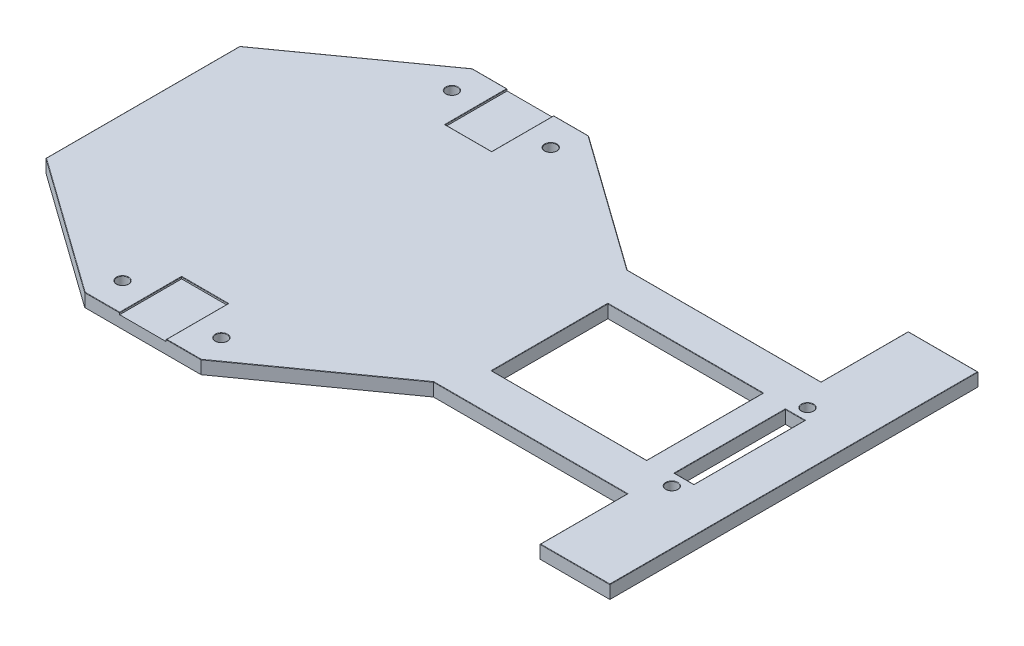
from build123d import *

# Parameters (mm, degrees)
CROQUIS1_R              = 1.5
CROQUIS1_W              = 40
CROQUIS1_H              = 30
CROQUIS1_W_2            = 5
CROQUIS1_H_2            = 28.6
SALIENTE_EXTRUIR1_DEPTH = 3.4
CROQUIS2_W              = 12
CROQUIS2_H              = 16
CORTAR_EXTRUIR1_DEPTH   = 0.5
REDONDEO1_R             = 0.1


with BuildPart() as part:
    # Croquis1 → Saliente-Extruir1 (new body)
    with BuildSketch(Plane(origin=(0, 0, 0), x_dir=(1, 0, 0), z_dir=(0, 1, 0))):
        Polygon((0, 0), (0, 50), (35, 75), (65, 75), (100, 50), (150, 50), (150, 72.5), (168, 72.5), (168, -22.5), (150, -22.5), (150, 0), (100, 0), (65, -25), (35, -25), align=None)
        with Locations(Location((154, 42.5, 0), (0, 0, 270))):
            Circle(CROQUIS1_R, mode=Mode.SUBTRACT)
        with Locations(Location((154, 7.5, 0), (0, 0, 270))):
            Circle(CROQUIS1_R, mode=Mode.SUBTRACT)
        with Locations(Location((37.25, 67.5, 0), (0, 0, 270))):
            Circle(CROQUIS1_R, mode=Mode.SUBTRACT)
        with Locations(Location((62.75, 67.5, 0), (0, 0, 270))):
            Circle(CROQUIS1_R, mode=Mode.SUBTRACT)
        with Locations(Location((62.75, -17.5, 0), (0, 0, 90))):
            Circle(CROQUIS1_R, mode=Mode.SUBTRACT)
        with Locations(Location((37.25, -17.5, 0), (0, 0, 90))):
            Circle(CROQUIS1_R, mode=Mode.SUBTRACT)
        with Locations((125, 25)):
            Rectangle(CROQUIS1_W, CROQUIS1_H, mode=Mode.SUBTRACT)
        with Locations((154, 25)):
            Rectangle(CROQUIS1_W_2, CROQUIS1_H_2, mode=Mode.SUBTRACT)
    extrude(amount=SALIENTE_EXTRUIR1_DEPTH)

    # Croquis2 → Cortar-Extruir1 (cut)
    with BuildSketch(Plane(origin=(0, 3.4, 0), x_dir=(1, 0, 0), z_dir=(0, 1, 0))):
        with Locations((50, 67)):
            Rectangle(CROQUIS2_W, CROQUIS2_H)
        with Locations((50, -17)):
            Rectangle(CROQUIS2_W, CROQUIS2_H)
    extrude(amount=-CORTAR_EXTRUIR1_DEPTH, mode=Mode.SUBTRACT)

    # Redondeo1
    redondeo1_edges = [part.edges().sort_by_distance(p)[0] for p in [
        (60.5, 3.4, 25),
        (44, 3.4, -67),
        (50, 3.4, -59),
        (56, 3.4, -67),
        (56, 3.4, 17),
        (50, 3.4, 9),
        (44, 3.4, 17),
        (82.5, 3.4, 12.5),
        (125, 3.4, 0),
        (150, 3.4, 11.25),
        (159, 3.4, 22.5),
        (168, 3.4, -25),
        (159, 3.4, -72.5),
        (150, 3.4, -61.25),
        (145, 3.4, -25),
        (125, 3.4, -40),
        (105, 3.4, -25),
        (125, 3.4, -10),
        (125, 3.4, -50),
        (82.5, 3.4, -62.5),
        (60.5, 3.4, -75),
        (17.5, 3.4, 12.5),
        (156.5, 3.4, -25),
        (17.5, 3.4, -62.5),
        (154, 3.4, -39.3),
        (151.5, 3.4, -25),
        (154, 3.4, -10.7),
        (0, 3.4, -25),
        (154, 3.4, -9),
        (154, 3.4, -44),
        (37.25, 3.4, -69),
        (62.75, 3.4, -69),
        (62.75, 3.4, 19),
        (37.25, 3.4, 19),
        (39.5, 3.4, 25),
        (39.5, 3.4, -75),
    ]]
    fillet(redondeo1_edges, radius=REDONDEO1_R)


solid = part.part
